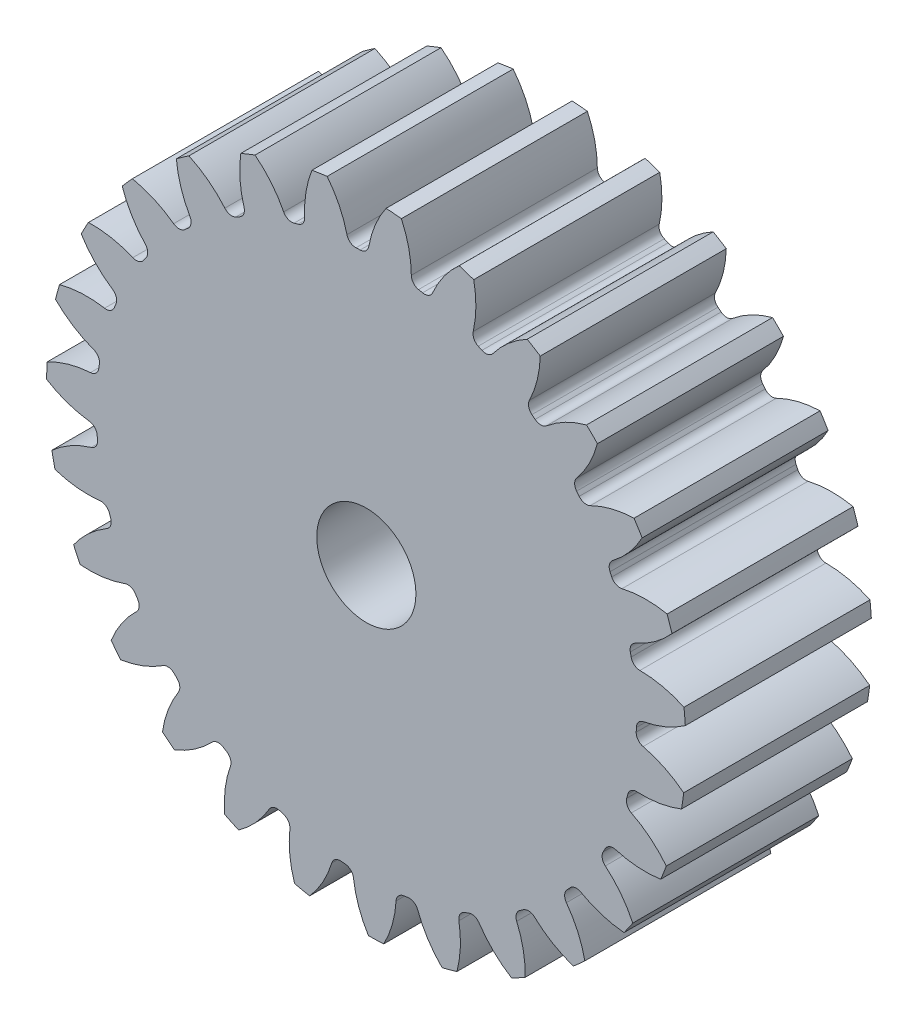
from build123d import *

# Parameters (mm, degrees)
SKETCH3_R         = 163.688888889
GEARBODY_DEPTH    = 95.25
TOOTHCUT_DEPTH    = 251.321128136
CIRPATTERN1_COUNT = 27
BOREDIA_R         = 25.4
BORE_DEPTH        = 12700


with BuildPart() as part:
    # Sketch3 → gearBody (new body)
    with BuildSketch(Plane.XY):
        Circle(SKETCH3_R)
    extrude(amount=GEARBODY_DEPTH)

    # Sketch2 → toothCut (cut, through all)
    with BuildSketch(Plane.XY):
        with BuildLine():
            ThreePointArc((138.202762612, -4.879876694), (138.23594538, -3.826250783), (138.261095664, -2.772402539))
            ThreePointArc((138.261095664, -2.772402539), (139.355404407, 0.112854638), (142.028174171, 1.655100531))
            ThreePointArc((142.028174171, 1.655100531), (153.36332699, 5.044989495), (163.688888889, 10.820784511))
            ThreePointArc((163.688888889, 10.820784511), (163.983352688, -4.538916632), (162.839704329, -19.858812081))
            ThreePointArc((162.839704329, -19.858812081), (152.849445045, -13.520692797), (141.719162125, -9.508980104))
            ThreePointArc((141.719162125, -9.508980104), (139.135795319, -7.821248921), (138.202762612, -4.879876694))
        make_face()
    toothcut = extrude(amount=TOOTHCUT_DEPTH, mode=Mode.SUBTRACT)

    # CirPattern1: toothCut ×27 about axis
    cirpattern1_axis = Axis((0, 0, 0), (0, 0, 1))
    for i in range(1, CIRPATTERN1_COUNT):
        add(toothcut.rotate(cirpattern1_axis, i * 360 / CIRPATTERN1_COUNT), mode=Mode.SUBTRACT)

    # boreDia → bore (cut, symmetric)
    with BuildSketch(Plane.XY):
        Circle(BOREDIA_R)
    extrude(amount=BORE_DEPTH, both=True, mode=Mode.SUBTRACT)


solid = part.part
